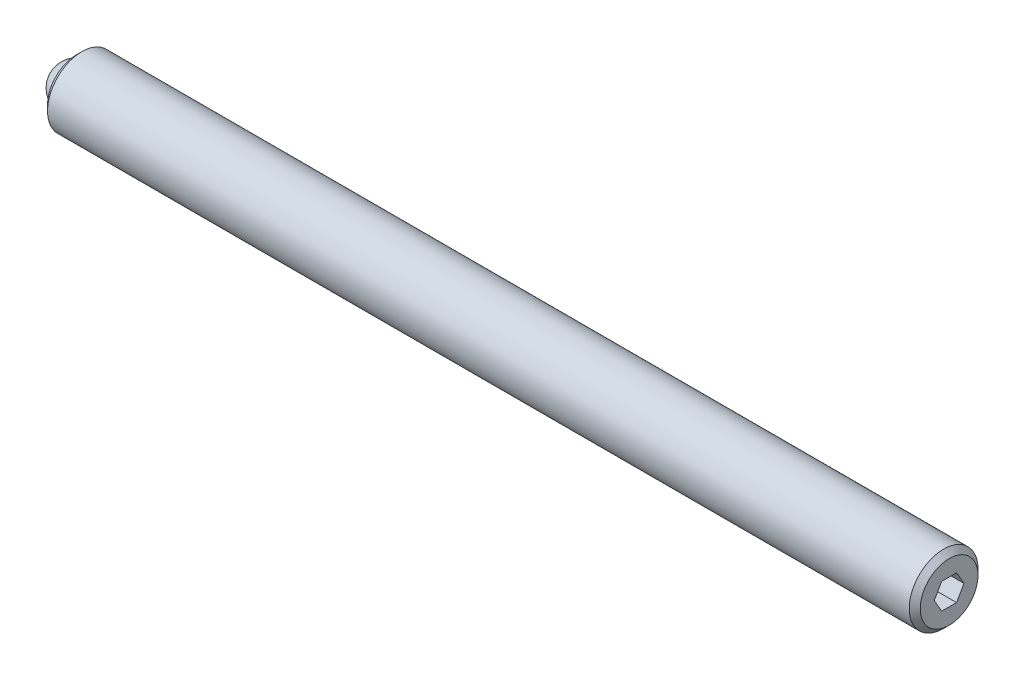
ISO-10303-21;
HEADER;
FILE_DESCRIPTION(('STEP AP214'),'2;1');
FILE_NAME('part.step','',(''),(''),'','','');
FILE_SCHEMA(('AUTOMOTIVE_DESIGN { 1 0 10303 214 1 1 1 1 }'));
ENDSEC;
DATA;
#1=APPLICATION_CONTEXT('core data for automotive mechanical design processes');
#2=APPLICATION_PROTOCOL_DEFINITION('international standard','automotive_design',2000,#1);
#3=PRODUCT_CONTEXT('',#1,'mechanical');
#4=PRODUCT('Part','Part','',(#3));
#5=PRODUCT_RELATED_PRODUCT_CATEGORY('part','',(#4));
#6=PRODUCT_DEFINITION_FORMATION('','',#4);
#7=PRODUCT_DEFINITION_CONTEXT('part definition',#1,'design');
#8=PRODUCT_DEFINITION('design','',#6,#7);
#9=PRODUCT_DEFINITION_SHAPE('','',#8);
#10=(LENGTH_UNIT() NAMED_UNIT(*) SI_UNIT(.MILLI.,.METRE.));
#11=(NAMED_UNIT(*) PLANE_ANGLE_UNIT() SI_UNIT($,.RADIAN.));
#12=(NAMED_UNIT(*) SI_UNIT($,.STERADIAN.) SOLID_ANGLE_UNIT());
#13=UNCERTAINTY_MEASURE_WITH_UNIT(LENGTH_MEASURE(1.E-05),#10,'distance_accuracy_value','');
#14=(GEOMETRIC_REPRESENTATION_CONTEXT(3) GLOBAL_UNCERTAINTY_ASSIGNED_CONTEXT((#13)) GLOBAL_UNIT_ASSIGNED_CONTEXT((#10,
#11,#12)) REPRESENTATION_CONTEXT('',''));
#15=CARTESIAN_POINT('',(0.,0.,0.));
#16=DIRECTION('',(0.,0.,1.));
#17=DIRECTION('',(1.,0.,0.));
#18=AXIS2_PLACEMENT_3D('',#15,#16,#17);
#19=CARTESIAN_POINT('',(0.,0.,0.));
#20=DIRECTION('',(0.,-1.,0.));
#21=DIRECTION('',(0.,0.,1.));
#22=AXIS2_PLACEMENT_3D('',#19,#20,#21);
#23=SPHERICAL_SURFACE('',#22,1.984375);
#24=CARTESIAN_POINT('',(0.,-1.984375,0.));
#25=VERTEX_POINT('',#24);
#26=VERTEX_LOOP('',#25);
#27=FACE_BOUND('',#26,.T.);
#28=ADVANCED_FACE('F41',(#27),#23,.T.);
#29=CLOSED_SHELL('',(#28));
#30=MANIFOLD_SOLID_BREP('B2',#29);
#31=CARTESIAN_POINT('',(80.565625,0.,0.));
#32=DIRECTION('',(-1.,0.,0.));
#33=DIRECTION('',(0.,0.,1.));
#34=AXIS2_PLACEMENT_3D('',#31,#32,#33);
#35=CYLINDRICAL_SURFACE('',#34,3.175);
#36=CARTESIAN_POINT('',(80.057625,0.,0.));
#37=DIRECTION('',(1.,0.,0.));
#38=DIRECTION('',(0.,0.,-1.));
#39=AXIS2_PLACEMENT_3D('',#36,#37,#38);
#40=CIRCLE('',#39,3.175);
#41=CARTESIAN_POINT('',(80.057625,0.,-3.175));
#42=VERTEX_POINT('',#41);
#43=EDGE_CURVE('E39',#42,#42,#40,.F.);
#44=ORIENTED_EDGE('',*,*,#43,.T.);
#45=EDGE_LOOP('',(#44));
#46=FACE_BOUND('',#45,.T.);
#47=CARTESIAN_POINT('',(0.508000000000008,0.,0.));
#48=DIRECTION('',(1.,0.,0.));
#49=DIRECTION('',(0.,0.,-1.));
#50=AXIS2_PLACEMENT_3D('',#47,#48,#49);
#51=CIRCLE('',#50,3.175);
#52=CARTESIAN_POINT('',(0.508000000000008,0.,-3.175));
#53=VERTEX_POINT('',#52);
#54=EDGE_CURVE('E157',#53,#53,#51,.T.);
#55=ORIENTED_EDGE('',*,*,#54,.T.);
#56=EDGE_LOOP('',(#55));
#57=FACE_BOUND('',#56,.T.);
#58=ADVANCED_FACE('F54',(#46,#57),#35,.T.);
#59=CARTESIAN_POINT('',(80.565625,0.,0.));
#60=DIRECTION('',(1.,0.,0.));
#61=DIRECTION('',(0.,0.,-1.));
#62=AXIS2_PLACEMENT_3D('',#59,#60,#61);
#63=PLANE('',#62);
#64=DIRECTION('',(0.,0.866025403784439,-0.5));
#65=VECTOR('',#64,1.);
#66=CARTESIAN_POINT('',(80.565625,-1.190625,-0.687407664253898));
#67=LINE('',#66,#65);
#68=CARTESIAN_POINT('',(80.565625,-1.190625,-0.687407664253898));
#69=VERTEX_POINT('',#68);
#70=CARTESIAN_POINT('',(80.565625,0.,-1.3748153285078));
#71=VERTEX_POINT('',#70);
#72=EDGE_CURVE('E69',#69,#71,#67,.T.);
#73=ORIENTED_EDGE('',*,*,#72,.F.);
#74=DIRECTION('',(0.,0.,-1.));
#75=VECTOR('',#74,1.);
#76=CARTESIAN_POINT('',(80.565625,-1.190625,0.687407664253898));
#77=LINE('',#76,#75);
#78=CARTESIAN_POINT('',(80.565625,-1.190625,0.687407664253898));
#79=VERTEX_POINT('',#78);
#80=EDGE_CURVE('E153',#79,#69,#77,.T.);
#81=ORIENTED_EDGE('',*,*,#80,.F.);
#82=DIRECTION('',(0.,-0.866025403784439,-0.5));
#83=VECTOR('',#82,1.);
#84=CARTESIAN_POINT('',(80.565625,0.,1.3748153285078));
#85=LINE('',#84,#83);
#86=CARTESIAN_POINT('',(80.565625,0.,1.3748153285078));
#87=VERTEX_POINT('',#86);
#88=EDGE_CURVE('E151',#87,#79,#85,.T.);
#89=ORIENTED_EDGE('',*,*,#88,.F.);
#90=DIRECTION('',(0.,-0.866025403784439,0.5));
#91=VECTOR('',#90,1.);
#92=CARTESIAN_POINT('',(80.565625,1.190625,0.687407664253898));
#93=LINE('',#92,#91);
#94=CARTESIAN_POINT('',(80.565625,1.190625,0.687407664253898));
#95=VERTEX_POINT('',#94);
#96=EDGE_CURVE('E117',#95,#87,#93,.T.);
#97=ORIENTED_EDGE('',*,*,#96,.F.);
#98=DIRECTION('',(0.,0.,1.));
#99=VECTOR('',#98,1.);
#100=CARTESIAN_POINT('',(80.565625,1.190625,-0.687407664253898));
#101=LINE('',#100,#99);
#102=CARTESIAN_POINT('',(80.565625,1.190625,-0.687407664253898));
#103=VERTEX_POINT('',#102);
#104=EDGE_CURVE('E147',#103,#95,#101,.T.);
#105=ORIENTED_EDGE('',*,*,#104,.F.);
#106=DIRECTION('',(0.,0.866025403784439,0.5));
#107=VECTOR('',#106,1.);
#108=CARTESIAN_POINT('',(80.565625,0.,-1.3748153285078));
#109=LINE('',#108,#107);
#110=EDGE_CURVE('E143',#71,#103,#109,.T.);
#111=ORIENTED_EDGE('',*,*,#110,.F.);
#112=EDGE_LOOP('',(#73,#81,#89,#97,#105,#111));
#113=FACE_BOUND('',#112,.T.);
#114=CARTESIAN_POINT('',(80.565625,0.,0.));
#115=DIRECTION('',(1.,0.,0.));
#116=DIRECTION('',(0.,0.,-1.));
#117=AXIS2_PLACEMENT_3D('',#114,#115,#116);
#118=CIRCLE('',#117,2.66700000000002);
#119=CARTESIAN_POINT('',(80.565625,0.,-2.66700000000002));
#120=VERTEX_POINT('',#119);
#121=EDGE_CURVE('E62',#120,#120,#118,.T.);
#122=ORIENTED_EDGE('',*,*,#121,.T.);
#123=EDGE_LOOP('',(#122));
#124=FACE_BOUND('',#123,.T.);
#125=ADVANCED_FACE('F170',(#113,#124),#63,.T.);
#126=CARTESIAN_POINT('',(0.,0.,0.));
#127=DIRECTION('',(1.,0.,0.));
#128=DIRECTION('',(0.,0.,-1.));
#129=AXIS2_PLACEMENT_3D('',#126,#127,#128);
#130=PLANE('',#129);
#131=CARTESIAN_POINT('',(0.,0.,0.));
#132=DIRECTION('',(-1.,0.,0.));
#133=DIRECTION('',(0.,0.,1.));
#134=AXIS2_PLACEMENT_3D('',#131,#132,#133);
#135=CIRCLE('',#134,1.9812);
#136=CARTESIAN_POINT('',(0.,0.,1.9812));
#137=VERTEX_POINT('',#136);
#138=EDGE_CURVE('E225',#137,#137,#135,.T.);
#139=ORIENTED_EDGE('',*,*,#138,.F.);
#140=EDGE_LOOP('',(#139));
#141=FACE_BOUND('',#140,.T.);
#142=CARTESIAN_POINT('',(0.,0.,0.));
#143=DIRECTION('',(1.,0.,0.));
#144=DIRECTION('',(0.,0.,-1.));
#145=AXIS2_PLACEMENT_3D('',#142,#143,#144);
#146=CIRCLE('',#145,2.66699999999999);
#147=CARTESIAN_POINT('',(0.,0.,-2.66699999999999));
#148=VERTEX_POINT('',#147);
#149=EDGE_CURVE('E165',#148,#148,#146,.F.);
#150=ORIENTED_EDGE('',*,*,#149,.T.);
#151=EDGE_LOOP('',(#150));
#152=FACE_BOUND('',#151,.T.);
#153=ADVANCED_FACE('F182',(#141,#152),#130,.F.);
#154=CARTESIAN_POINT('',(0.508000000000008,0.,0.));
#155=DIRECTION('',(1.,0.,0.));
#156=DIRECTION('',(0.,0.,-1.));
#157=AXIS2_PLACEMENT_3D('',#154,#155,#156);
#158=CONICAL_SURFACE('',#157,3.175,0.78539816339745);
#159=ORIENTED_EDGE('',*,*,#149,.F.);
#160=EDGE_LOOP('',(#159));
#161=FACE_BOUND('',#160,.T.);
#162=ORIENTED_EDGE('',*,*,#54,.F.);
#163=EDGE_LOOP('',(#162));
#164=FACE_BOUND('',#163,.T.);
#165=ADVANCED_FACE('F174',(#161,#164),#158,.T.);
#166=CARTESIAN_POINT('',(80.565625,0.,0.));
#167=DIRECTION('',(-1.,0.,0.));
#168=DIRECTION('',(0.,0.,1.));
#169=AXIS2_PLACEMENT_3D('',#166,#167,#168);
#170=CONICAL_SURFACE('',#169,2.66700000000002,0.785398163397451);
#171=ORIENTED_EDGE('',*,*,#43,.F.);
#172=EDGE_LOOP('',(#171));
#173=FACE_BOUND('',#172,.T.);
#174=ORIENTED_EDGE('',*,*,#121,.F.);
#175=EDGE_LOOP('',(#174));
#176=FACE_BOUND('',#175,.T.);
#177=ADVANCED_FACE('F56',(#173,#176),#170,.T.);
#178=CARTESIAN_POINT('',(78.279625,-1.190625,-0.687407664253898));
#179=DIRECTION('',(0.,-0.5,-0.866025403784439));
#180=DIRECTION('',(0.,0.866025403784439,-0.5));
#181=AXIS2_PLACEMENT_3D('',#178,#179,#180);
#182=PLANE('',#181);
#183=ORIENTED_EDGE('',*,*,#72,.T.);
#184=DIRECTION('',(1.,0.,0.));
#185=VECTOR('',#184,1.);
#186=CARTESIAN_POINT('',(78.279625,0.,-1.3748153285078));
#187=LINE('',#186,#185);
#188=CARTESIAN_POINT('',(78.279625,0.,-1.3748153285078));
#189=VERTEX_POINT('',#188);
#190=EDGE_CURVE('E99',#189,#71,#187,.T.);
#191=ORIENTED_EDGE('',*,*,#190,.F.);
#192=DIRECTION('',(0.,0.866025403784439,-0.5));
#193=VECTOR('',#192,1.);
#194=CARTESIAN_POINT('',(78.279625,-1.190625,-0.687407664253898));
#195=LINE('',#194,#193);
#196=CARTESIAN_POINT('',(78.279625,-1.190625,-0.687407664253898));
#197=VERTEX_POINT('',#196);
#198=EDGE_CURVE('E155',#197,#189,#195,.T.);
#199=ORIENTED_EDGE('',*,*,#198,.F.);
#200=DIRECTION('',(1.,0.,0.));
#201=VECTOR('',#200,1.);
#202=CARTESIAN_POINT('',(78.279625,-1.190625,-0.687407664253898));
#203=LINE('',#202,#201);
#204=EDGE_CURVE('E77',#197,#69,#203,.T.);
#205=ORIENTED_EDGE('',*,*,#204,.T.);
#206=EDGE_LOOP('',(#183,#191,#199,#205));
#207=FACE_BOUND('',#206,.T.);
#208=ADVANCED_FACE('F173',(#207),#182,.F.);
#209=CARTESIAN_POINT('',(78.279625,-1.190625,0.687407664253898));
#210=DIRECTION('',(0.,-1.,0.));
#211=DIRECTION('',(0.,0.,-1.));
#212=AXIS2_PLACEMENT_3D('',#209,#210,#211);
#213=PLANE('',#212);
#214=ORIENTED_EDGE('',*,*,#80,.T.);
#215=ORIENTED_EDGE('',*,*,#204,.F.);
#216=DIRECTION('',(0.,0.,-1.));
#217=VECTOR('',#216,1.);
#218=CARTESIAN_POINT('',(78.279625,-1.190625,0.687407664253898));
#219=LINE('',#218,#217);
#220=CARTESIAN_POINT('',(78.279625,-1.190625,0.687407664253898));
#221=VERTEX_POINT('',#220);
#222=EDGE_CURVE('E129',#221,#197,#219,.T.);
#223=ORIENTED_EDGE('',*,*,#222,.F.);
#224=DIRECTION('',(1.,0.,0.));
#225=VECTOR('',#224,1.);
#226=CARTESIAN_POINT('',(78.279625,-1.190625,0.687407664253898));
#227=LINE('',#226,#225);
#228=EDGE_CURVE('E121',#221,#79,#227,.T.);
#229=ORIENTED_EDGE('',*,*,#228,.T.);
#230=EDGE_LOOP('',(#214,#215,#223,#229));
#231=FACE_BOUND('',#230,.T.);
#232=ADVANCED_FACE('F180',(#231),#213,.F.);
#233=CARTESIAN_POINT('',(78.279625,0.,1.3748153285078));
#234=DIRECTION('',(0.,-0.5,0.866025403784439));
#235=DIRECTION('',(0.,-0.866025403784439,-0.5));
#236=AXIS2_PLACEMENT_3D('',#233,#234,#235);
#237=PLANE('',#236);
#238=ORIENTED_EDGE('',*,*,#88,.T.);
#239=ORIENTED_EDGE('',*,*,#228,.F.);
#240=DIRECTION('',(0.,-0.866025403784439,-0.5));
#241=VECTOR('',#240,1.);
#242=CARTESIAN_POINT('',(78.279625,0.,1.3748153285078));
#243=LINE('',#242,#241);
#244=CARTESIAN_POINT('',(78.279625,0.,1.3748153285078));
#245=VERTEX_POINT('',#244);
#246=EDGE_CURVE('E125',#245,#221,#243,.T.);
#247=ORIENTED_EDGE('',*,*,#246,.F.);
#248=DIRECTION('',(1.,0.,0.));
#249=VECTOR('',#248,1.);
#250=CARTESIAN_POINT('',(78.279625,0.,1.3748153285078));
#251=LINE('',#250,#249);
#252=EDGE_CURVE('E110',#245,#87,#251,.T.);
#253=ORIENTED_EDGE('',*,*,#252,.T.);
#254=EDGE_LOOP('',(#238,#239,#247,#253));
#255=FACE_BOUND('',#254,.T.);
#256=ADVANCED_FACE('F126',(#255),#237,.F.);
#257=CARTESIAN_POINT('',(78.279625,1.190625,0.687407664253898));
#258=DIRECTION('',(0.,0.5,0.866025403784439));
#259=DIRECTION('',(0.,-0.866025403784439,0.5));
#260=AXIS2_PLACEMENT_3D('',#257,#258,#259);
#261=PLANE('',#260);
#262=ORIENTED_EDGE('',*,*,#96,.T.);
#263=ORIENTED_EDGE('',*,*,#252,.F.);
#264=DIRECTION('',(0.,-0.866025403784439,0.5));
#265=VECTOR('',#264,1.);
#266=CARTESIAN_POINT('',(78.279625,1.190625,0.687407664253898));
#267=LINE('',#266,#265);
#268=CARTESIAN_POINT('',(78.279625,1.190625,0.687407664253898));
#269=VERTEX_POINT('',#268);
#270=EDGE_CURVE('E114',#269,#245,#267,.T.);
#271=ORIENTED_EDGE('',*,*,#270,.F.);
#272=DIRECTION('',(1.,0.,0.));
#273=VECTOR('',#272,1.);
#274=CARTESIAN_POINT('',(78.279625,1.190625,0.687407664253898));
#275=LINE('',#274,#273);
#276=EDGE_CURVE('E122',#269,#95,#275,.T.);
#277=ORIENTED_EDGE('',*,*,#276,.T.);
#278=EDGE_LOOP('',(#262,#263,#271,#277));
#279=FACE_BOUND('',#278,.T.);
#280=ADVANCED_FACE('F112',(#279),#261,.F.);
#281=CARTESIAN_POINT('',(78.279625,1.190625,-0.687407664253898));
#282=DIRECTION('',(0.,1.,0.));
#283=DIRECTION('',(0.,0.,1.));
#284=AXIS2_PLACEMENT_3D('',#281,#282,#283);
#285=PLANE('',#284);
#286=ORIENTED_EDGE('',*,*,#104,.T.);
#287=ORIENTED_EDGE('',*,*,#276,.F.);
#288=DIRECTION('',(0.,0.,1.));
#289=VECTOR('',#288,1.);
#290=CARTESIAN_POINT('',(78.279625,1.190625,-0.687407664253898));
#291=LINE('',#290,#289);
#292=CARTESIAN_POINT('',(78.279625,1.190625,-0.687407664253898));
#293=VERTEX_POINT('',#292);
#294=EDGE_CURVE('E135',#293,#269,#291,.T.);
#295=ORIENTED_EDGE('',*,*,#294,.F.);
#296=DIRECTION('',(1.,0.,0.));
#297=VECTOR('',#296,1.);
#298=CARTESIAN_POINT('',(78.279625,1.190625,-0.687407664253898));
#299=LINE('',#298,#297);
#300=EDGE_CURVE('E160',#293,#103,#299,.T.);
#301=ORIENTED_EDGE('',*,*,#300,.T.);
#302=EDGE_LOOP('',(#286,#287,#295,#301));
#303=FACE_BOUND('',#302,.T.);
#304=ADVANCED_FACE('F201',(#303),#285,.F.);
#305=CARTESIAN_POINT('',(78.279625,0.,-1.3748153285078));
#306=DIRECTION('',(0.,0.5,-0.866025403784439));
#307=DIRECTION('',(0.,0.866025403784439,0.5));
#308=AXIS2_PLACEMENT_3D('',#305,#306,#307);
#309=PLANE('',#308);
#310=ORIENTED_EDGE('',*,*,#110,.T.);
#311=ORIENTED_EDGE('',*,*,#300,.F.);
#312=DIRECTION('',(0.,0.866025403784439,0.5));
#313=VECTOR('',#312,1.);
#314=CARTESIAN_POINT('',(78.279625,0.,-1.3748153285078));
#315=LINE('',#314,#313);
#316=EDGE_CURVE('E137',#189,#293,#315,.T.);
#317=ORIENTED_EDGE('',*,*,#316,.F.);
#318=ORIENTED_EDGE('',*,*,#190,.T.);
#319=EDGE_LOOP('',(#310,#311,#317,#318));
#320=FACE_BOUND('',#319,.T.);
#321=ADVANCED_FACE('F198',(#320),#309,.F.);
#322=CARTESIAN_POINT('',(78.279625,0.,0.));
#323=DIRECTION('',(1.,0.,0.));
#324=DIRECTION('',(0.,0.,-1.));
#325=AXIS2_PLACEMENT_3D('',#322,#323,#324);
#326=PLANE('',#325);
#327=ORIENTED_EDGE('',*,*,#198,.T.);
#328=ORIENTED_EDGE('',*,*,#316,.T.);
#329=ORIENTED_EDGE('',*,*,#294,.T.);
#330=ORIENTED_EDGE('',*,*,#270,.T.);
#331=ORIENTED_EDGE('',*,*,#246,.T.);
#332=ORIENTED_EDGE('',*,*,#222,.T.);
#333=EDGE_LOOP('',(#327,#328,#329,#330,#331,#332));
#334=FACE_BOUND('',#333,.T.);
#335=ADVANCED_FACE('F132',(#334),#326,.T.);
#336=CARTESIAN_POINT('',(1.984375,0.,0.));
#337=DIRECTION('',(-1.,0.,0.));
#338=DIRECTION('',(0.,0.,1.));
#339=AXIS2_PLACEMENT_3D('',#336,#337,#338);
#340=CYLINDRICAL_SURFACE('',#339,1.9812);
#341=CARTESIAN_POINT('',(1.984375,0.,0.));
#342=DIRECTION('',(-1.,0.,0.));
#343=DIRECTION('',(0.,0.,1.));
#344=AXIS2_PLACEMENT_3D('',#341,#342,#343);
#345=CIRCLE('',#344,1.9812);
#346=CARTESIAN_POINT('',(1.984375,0.,1.9812));
#347=VERTEX_POINT('',#346);
#348=EDGE_CURVE('E144',#347,#347,#345,.T.);
#349=ORIENTED_EDGE('',*,*,#348,.F.);
#350=EDGE_LOOP('',(#349));
#351=FACE_BOUND('',#350,.T.);
#352=ORIENTED_EDGE('',*,*,#138,.T.);
#353=EDGE_LOOP('',(#352));
#354=FACE_BOUND('',#353,.T.);
#355=ADVANCED_FACE('F214',(#351,#354),#340,.F.);
#356=CARTESIAN_POINT('',(1.984375,0.,0.));
#357=DIRECTION('',(-1.,0.,0.));
#358=DIRECTION('',(0.,0.,1.));
#359=AXIS2_PLACEMENT_3D('',#356,#357,#358);
#360=PLANE('',#359);
#361=ORIENTED_EDGE('',*,*,#348,.T.);
#362=EDGE_LOOP('',(#361));
#363=FACE_BOUND('',#362,.T.);
#364=ADVANCED_FACE('F217',(#363),#360,.T.);
#365=CLOSED_SHELL('',(#58,#125,#153,#165,#177,#208,#232,#256,#280,#304,#321,#335,#355,#364));
#366=MANIFOLD_SOLID_BREP('B6',#365);
#367=ADVANCED_BREP_SHAPE_REPRESENTATION('',(#18,#30,#366),#14);
#368=SHAPE_DEFINITION_REPRESENTATION(#9,#367);
ENDSEC;
END-ISO-10303-21;
